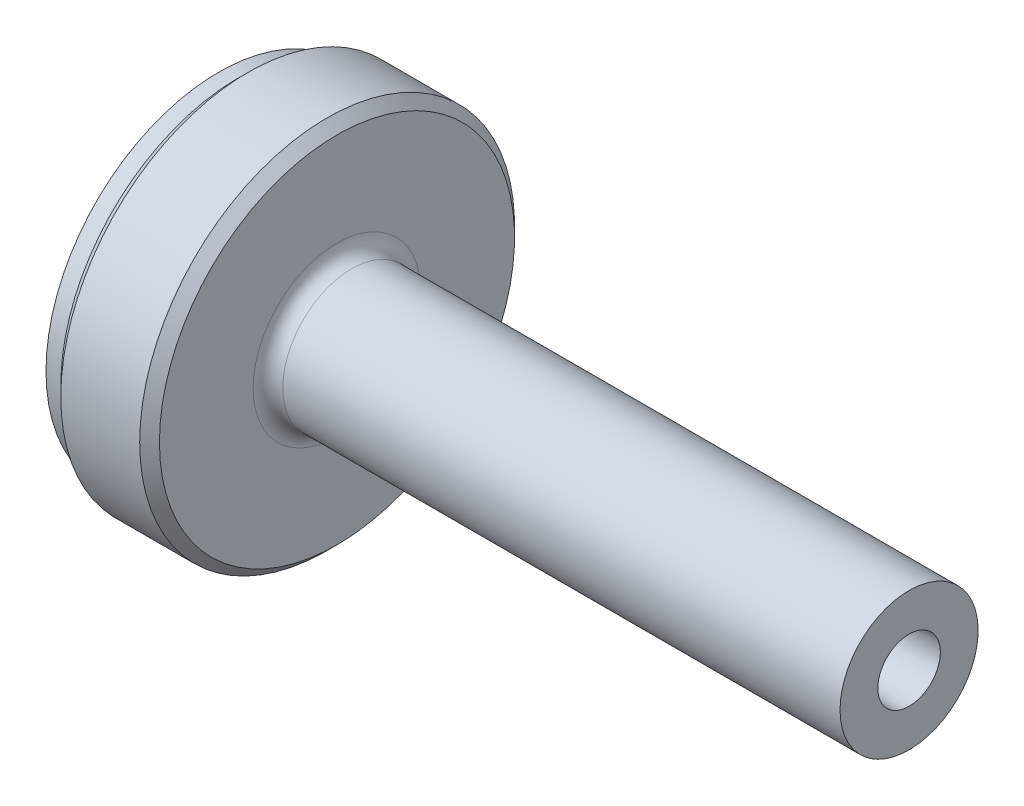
ISO-10303-21;
HEADER;
FILE_DESCRIPTION(('STEP AP214'),'2;1');
FILE_NAME('part.step','',(''),(''),'','','');
FILE_SCHEMA(('AUTOMOTIVE_DESIGN { 1 0 10303 214 1 1 1 1 }'));
ENDSEC;
DATA;
#1=APPLICATION_CONTEXT('core data for automotive mechanical design processes');
#2=APPLICATION_PROTOCOL_DEFINITION('international standard','automotive_design',2000,#1);
#3=PRODUCT_CONTEXT('',#1,'mechanical');
#4=PRODUCT('Part','Part','',(#3));
#5=PRODUCT_RELATED_PRODUCT_CATEGORY('part','',(#4));
#6=PRODUCT_DEFINITION_FORMATION('','',#4);
#7=PRODUCT_DEFINITION_CONTEXT('part definition',#1,'design');
#8=PRODUCT_DEFINITION('design','',#6,#7);
#9=PRODUCT_DEFINITION_SHAPE('','',#8);
#10=(LENGTH_UNIT() NAMED_UNIT(*) SI_UNIT(.MILLI.,.METRE.));
#11=(NAMED_UNIT(*) PLANE_ANGLE_UNIT() SI_UNIT($,.RADIAN.));
#12=(NAMED_UNIT(*) SI_UNIT($,.STERADIAN.) SOLID_ANGLE_UNIT());
#13=UNCERTAINTY_MEASURE_WITH_UNIT(LENGTH_MEASURE(1.E-05),#10,'distance_accuracy_value','');
#14=(GEOMETRIC_REPRESENTATION_CONTEXT(3) GLOBAL_UNCERTAINTY_ASSIGNED_CONTEXT((#13)) GLOBAL_UNIT_ASSIGNED_CONTEXT((#10,
#11,#12)) REPRESENTATION_CONTEXT('',''));
#15=CARTESIAN_POINT('',(0.,0.,0.));
#16=DIRECTION('',(0.,0.,1.));
#17=DIRECTION('',(1.,0.,0.));
#18=AXIS2_PLACEMENT_3D('',#15,#16,#17);
#19=CARTESIAN_POINT('',(70.,7.,0.));
#20=DIRECTION('',(-1.,0.,0.));
#21=DIRECTION('',(0.,0.,1.));
#22=AXIS2_PLACEMENT_3D('',#19,#20,#21);
#23=PLANE('',#22);
#24=CARTESIAN_POINT('',(70.,0.,0.));
#25=DIRECTION('',(-1.,0.,0.));
#26=DIRECTION('',(0.,0.,1.));
#27=AXIS2_PLACEMENT_3D('',#24,#25,#26);
#28=CIRCLE('',#27,7.);
#29=CARTESIAN_POINT('',(70.,0.,7.));
#30=VERTEX_POINT('',#29);
#31=EDGE_CURVE('E40',#30,#30,#28,.T.);
#32=ORIENTED_EDGE('',*,*,#31,.F.);
#33=EDGE_LOOP('',(#32));
#34=FACE_BOUND('',#33,.T.);
#35=CARTESIAN_POINT('',(70.,0.,0.));
#36=DIRECTION('',(-1.,0.,0.));
#37=DIRECTION('',(0.,0.,1.));
#38=AXIS2_PLACEMENT_3D('',#35,#36,#37);
#39=CIRCLE('',#38,3.16948935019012);
#40=CARTESIAN_POINT('',(70.,0.,3.16948935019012));
#41=VERTEX_POINT('',#40);
#42=EDGE_CURVE('E55',#41,#41,#39,.T.);
#43=ORIENTED_EDGE('',*,*,#42,.T.);
#44=EDGE_LOOP('',(#43));
#45=FACE_BOUND('',#44,.T.);
#46=ADVANCED_FACE('F14',(#34,#45),#23,.F.);
#47=CARTESIAN_POINT('',(0.,0.,0.));
#48=DIRECTION('',(-1.,0.,0.));
#49=DIRECTION('',(0.,0.,1.));
#50=AXIS2_PLACEMENT_3D('',#47,#48,#49);
#51=CYLINDRICAL_SURFACE('',#50,7.);
#52=CARTESIAN_POINT('',(13.5,0.,0.));
#53=DIRECTION('',(-1.,0.,0.));
#54=DIRECTION('',(0.,0.,1.));
#55=AXIS2_PLACEMENT_3D('',#52,#53,#54);
#56=CIRCLE('',#55,7.);
#57=CARTESIAN_POINT('',(13.5,0.,7.));
#58=VERTEX_POINT('',#57);
#59=EDGE_CURVE('E9',#58,#58,#56,.F.);
#60=ORIENTED_EDGE('',*,*,#59,.T.);
#61=EDGE_LOOP('',(#60));
#62=FACE_BOUND('',#61,.T.);
#63=ORIENTED_EDGE('',*,*,#31,.T.);
#64=EDGE_LOOP('',(#63));
#65=FACE_BOUND('',#64,.T.);
#66=ADVANCED_FACE('F99',(#62,#65),#51,.T.);
#67=CARTESIAN_POINT('',(12.,19.,0.));
#68=DIRECTION('',(-1.,0.,0.));
#69=DIRECTION('',(0.,0.,1.));
#70=AXIS2_PLACEMENT_3D('',#67,#68,#69);
#71=PLANE('',#70);
#72=CARTESIAN_POINT('',(12.,0.,0.));
#73=DIRECTION('',(-1.,0.,0.));
#74=DIRECTION('',(0.,0.,1.));
#75=AXIS2_PLACEMENT_3D('',#72,#73,#74);
#76=CIRCLE('',#75,8.5);
#77=CARTESIAN_POINT('',(12.,0.,8.5));
#78=VERTEX_POINT('',#77);
#79=EDGE_CURVE('E21',#78,#78,#76,.T.);
#80=ORIENTED_EDGE('',*,*,#79,.T.);
#81=EDGE_LOOP('',(#80));
#82=FACE_BOUND('',#81,.T.);
#83=CARTESIAN_POINT('',(12.,0.,0.));
#84=DIRECTION('',(-1.,0.,0.));
#85=DIRECTION('',(0.,0.,1.));
#86=AXIS2_PLACEMENT_3D('',#83,#84,#85);
#87=CIRCLE('',#86,18.);
#88=CARTESIAN_POINT('',(12.,0.,18.));
#89=VERTEX_POINT('',#88);
#90=EDGE_CURVE('E29',#89,#89,#87,.F.);
#91=ORIENTED_EDGE('',*,*,#90,.T.);
#92=EDGE_LOOP('',(#91));
#93=FACE_BOUND('',#92,.T.);
#94=ADVANCED_FACE('F95',(#82,#93),#71,.F.);
#95=CARTESIAN_POINT('',(0.,0.,0.));
#96=DIRECTION('',(-1.,0.,0.));
#97=DIRECTION('',(0.,0.,1.));
#98=AXIS2_PLACEMENT_3D('',#95,#96,#97);
#99=CYLINDRICAL_SURFACE('',#98,19.);
#100=CARTESIAN_POINT('',(11.,0.,0.));
#101=DIRECTION('',(-1.,0.,0.));
#102=DIRECTION('',(0.,0.,1.));
#103=AXIS2_PLACEMENT_3D('',#100,#101,#102);
#104=CIRCLE('',#103,19.);
#105=CARTESIAN_POINT('',(11.,0.,19.));
#106=VERTEX_POINT('',#105);
#107=EDGE_CURVE('E34',#106,#106,#104,.T.);
#108=ORIENTED_EDGE('',*,*,#107,.T.);
#109=EDGE_LOOP('',(#108));
#110=FACE_BOUND('',#109,.T.);
#111=CARTESIAN_POINT('',(3.,0.,0.));
#112=DIRECTION('',(1.,0.,0.));
#113=DIRECTION('',(0.,0.,-1.));
#114=AXIS2_PLACEMENT_3D('',#111,#112,#113);
#115=CIRCLE('',#114,19.);
#116=CARTESIAN_POINT('',(3.,0.,-19.));
#117=VERTEX_POINT('',#116);
#118=EDGE_CURVE('E37',#117,#117,#115,.T.);
#119=ORIENTED_EDGE('',*,*,#118,.T.);
#120=EDGE_LOOP('',(#119));
#121=FACE_BOUND('',#120,.T.);
#122=ADVANCED_FACE('F87',(#110,#121),#99,.T.);
#123=CARTESIAN_POINT('',(2.,17.5,0.));
#124=DIRECTION('',(1.,0.,0.));
#125=DIRECTION('',(0.,0.,-1.));
#126=AXIS2_PLACEMENT_3D('',#123,#124,#125);
#127=PLANE('',#126);
#128=CARTESIAN_POINT('',(2.,0.,0.));
#129=DIRECTION('',(1.,0.,0.));
#130=DIRECTION('',(0.,0.,-1.));
#131=AXIS2_PLACEMENT_3D('',#128,#129,#130);
#132=CIRCLE('',#131,18.);
#133=CARTESIAN_POINT('',(2.,0.,-18.));
#134=VERTEX_POINT('',#133);
#135=EDGE_CURVE('E25',#134,#134,#132,.F.);
#136=ORIENTED_EDGE('',*,*,#135,.T.);
#137=EDGE_LOOP('',(#136));
#138=FACE_BOUND('',#137,.T.);
#139=CARTESIAN_POINT('',(2.,0.,0.));
#140=DIRECTION('',(-1.,0.,0.));
#141=DIRECTION('',(0.,0.,1.));
#142=AXIS2_PLACEMENT_3D('',#139,#140,#141);
#143=CIRCLE('',#142,17.5);
#144=CARTESIAN_POINT('',(2.,0.,17.5));
#145=VERTEX_POINT('',#144);
#146=EDGE_CURVE('E43',#145,#145,#143,.T.);
#147=ORIENTED_EDGE('',*,*,#146,.F.);
#148=EDGE_LOOP('',(#147));
#149=FACE_BOUND('',#148,.T.);
#150=ADVANCED_FACE('F82',(#138,#149),#127,.F.);
#151=CARTESIAN_POINT('',(0.,0.,0.));
#152=DIRECTION('',(-1.,0.,0.));
#153=DIRECTION('',(0.,0.,1.));
#154=AXIS2_PLACEMENT_3D('',#151,#152,#153);
#155=CYLINDRICAL_SURFACE('',#154,17.5);
#156=CARTESIAN_POINT('',(0.,0.,0.));
#157=DIRECTION('',(-1.,0.,0.));
#158=DIRECTION('',(0.,0.,1.));
#159=AXIS2_PLACEMENT_3D('',#156,#157,#158);
#160=CIRCLE('',#159,17.5);
#161=CARTESIAN_POINT('',(0.,0.,17.5));
#162=VERTEX_POINT('',#161);
#163=EDGE_CURVE('E46',#162,#162,#160,.T.);
#164=ORIENTED_EDGE('',*,*,#163,.F.);
#165=EDGE_LOOP('',(#164));
#166=FACE_BOUND('',#165,.T.);
#167=ORIENTED_EDGE('',*,*,#146,.T.);
#168=EDGE_LOOP('',(#167));
#169=FACE_BOUND('',#168,.T.);
#170=ADVANCED_FACE('F76',(#166,#169),#155,.T.);
#171=CARTESIAN_POINT('',(0.,8.9624151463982,0.));
#172=DIRECTION('',(1.,0.,0.));
#173=DIRECTION('',(0.,0.,-1.));
#174=AXIS2_PLACEMENT_3D('',#171,#172,#173);
#175=PLANE('',#174);
#176=CARTESIAN_POINT('',(0.,0.,0.));
#177=DIRECTION('',(-1.,0.,0.));
#178=DIRECTION('',(0.,0.,1.));
#179=AXIS2_PLACEMENT_3D('',#176,#177,#178);
#180=CIRCLE('',#179,8.9624151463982);
#181=CARTESIAN_POINT('',(0.,0.,8.9624151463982));
#182=VERTEX_POINT('',#181);
#183=EDGE_CURVE('E49',#182,#182,#180,.T.);
#184=ORIENTED_EDGE('',*,*,#183,.F.);
#185=EDGE_LOOP('',(#184));
#186=FACE_BOUND('',#185,.T.);
#187=ORIENTED_EDGE('',*,*,#163,.T.);
#188=EDGE_LOOP('',(#187));
#189=FACE_BOUND('',#188,.T.);
#190=ADVANCED_FACE('F70',(#186,#189),#175,.F.);
#191=CARTESIAN_POINT('',(-11.8284890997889,0.,0.));
#192=DIRECTION('',(-1.,0.,0.));
#193=DIRECTION('',(0.,0.,1.));
#194=AXIS2_PLACEMENT_3D('',#191,#192,#193);
#195=DEGENERATE_TOROIDAL_SURFACE('',#194,0.261837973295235,15.,.F.);
#196=CARTESIAN_POINT('',(3.,0.,0.));
#197=DIRECTION('',(-1.,0.,0.));
#198=DIRECTION('',(0.,0.,1.));
#199=AXIS2_PLACEMENT_3D('',#196,#197,#198);
#200=CIRCLE('',#199,2.);
#201=CARTESIAN_POINT('',(3.,0.,2.));
#202=VERTEX_POINT('',#201);
#203=EDGE_CURVE('E52',#202,#202,#200,.T.);
#204=ORIENTED_EDGE('',*,*,#203,.F.);
#205=EDGE_LOOP('',(#204));
#206=FACE_BOUND('',#205,.T.);
#207=ORIENTED_EDGE('',*,*,#183,.T.);
#208=EDGE_LOOP('',(#207));
#209=FACE_BOUND('',#208,.T.);
#210=ADVANCED_FACE('F64',(#206,#209),#195,.T.);
#211=CARTESIAN_POINT('',(3.,0.,0.));
#212=DIRECTION('',(1.,0.,0.));
#213=DIRECTION('',(0.,0.,-1.));
#214=AXIS2_PLACEMENT_3D('',#211,#212,#213);
#215=CONICAL_SURFACE('',#214,2.,0.0174532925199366);
#216=ORIENTED_EDGE('',*,*,#42,.F.);
#217=EDGE_LOOP('',(#216));
#218=FACE_BOUND('',#217,.T.);
#219=ORIENTED_EDGE('',*,*,#203,.T.);
#220=EDGE_LOOP('',(#219));
#221=FACE_BOUND('',#220,.T.);
#222=ADVANCED_FACE('F60',(#218,#221),#215,.F.);
#223=CARTESIAN_POINT('',(11.,0.,0.));
#224=DIRECTION('',(-1.,0.,0.));
#225=DIRECTION('',(0.,0.,1.));
#226=AXIS2_PLACEMENT_3D('',#223,#224,#225);
#227=CONICAL_SURFACE('',#226,19.,0.78539816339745);
#228=ORIENTED_EDGE('',*,*,#90,.F.);
#229=EDGE_LOOP('',(#228));
#230=FACE_BOUND('',#229,.T.);
#231=ORIENTED_EDGE('',*,*,#107,.F.);
#232=EDGE_LOOP('',(#231));
#233=FACE_BOUND('',#232,.T.);
#234=ADVANCED_FACE('F63',(#230,#233),#227,.T.);
#235=CARTESIAN_POINT('',(2.,0.,0.));
#236=DIRECTION('',(1.,0.,0.));
#237=DIRECTION('',(0.,0.,-1.));
#238=AXIS2_PLACEMENT_3D('',#235,#236,#237);
#239=CONICAL_SURFACE('',#238,18.,0.78539816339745);
#240=ORIENTED_EDGE('',*,*,#118,.F.);
#241=EDGE_LOOP('',(#240));
#242=FACE_BOUND('',#241,.T.);
#243=ORIENTED_EDGE('',*,*,#135,.F.);
#244=EDGE_LOOP('',(#243));
#245=FACE_BOUND('',#244,.T.);
#246=ADVANCED_FACE('F111',(#242,#245),#239,.T.);
#247=CARTESIAN_POINT('',(13.5,0.,0.));
#248=DIRECTION('',(-1.,0.,0.));
#249=DIRECTION('',(0.,0.,1.));
#250=AXIS2_PLACEMENT_3D('',#247,#248,#249);
#251=TOROIDAL_SURFACE('',#250,8.5,1.5);
#252=ORIENTED_EDGE('',*,*,#59,.F.);
#253=EDGE_LOOP('',(#252));
#254=FACE_BOUND('',#253,.T.);
#255=ORIENTED_EDGE('',*,*,#79,.F.);
#256=EDGE_LOOP('',(#255));
#257=FACE_BOUND('',#256,.T.);
#258=ADVANCED_FACE('F16',(#254,#257),#251,.F.);
#259=CLOSED_SHELL('',(#46,#66,#94,#122,#150,#170,#190,#210,#222,#234,#246,#258));
#260=MANIFOLD_SOLID_BREP('B1',#259);
#261=ADVANCED_BREP_SHAPE_REPRESENTATION('',(#18,#260),#14);
#262=SHAPE_DEFINITION_REPRESENTATION(#9,#261);
ENDSEC;
END-ISO-10303-21;
